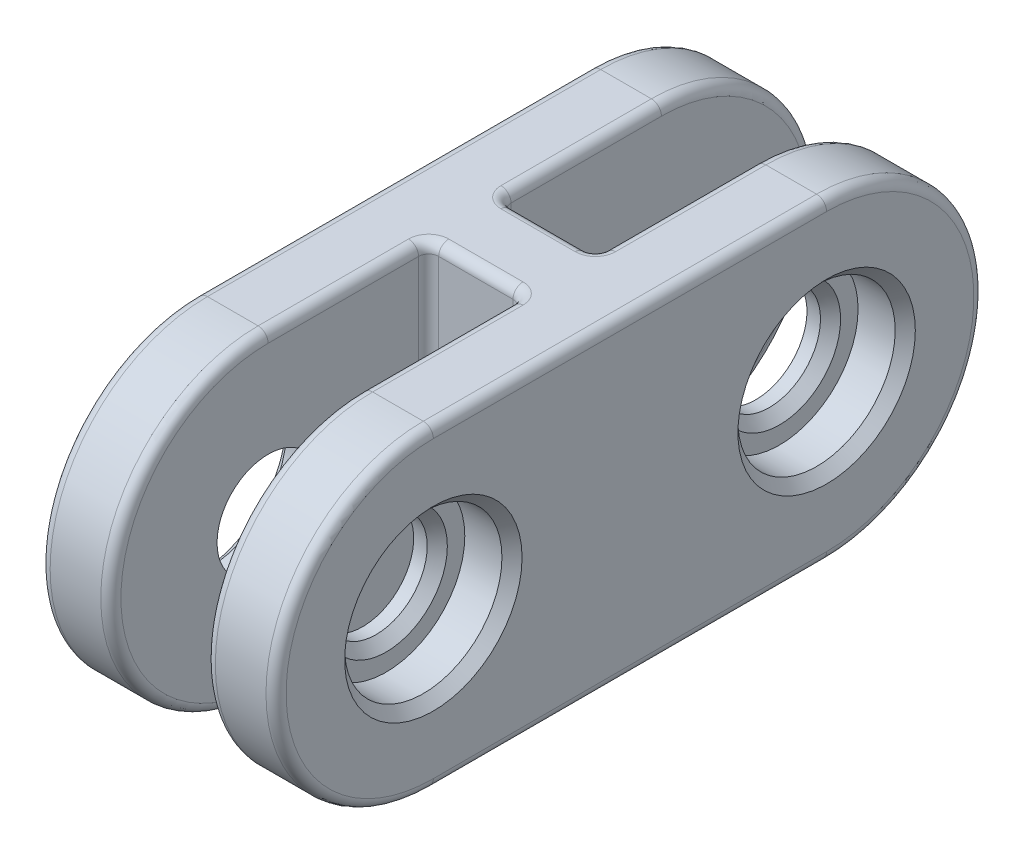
from build123d import *

# Parameters (mm, degrees)
SKETCH1_R          = 4.1275
EXTRUDE1_DEPTH     = 9.525
SKETCH2_R          = 6.35
CUT_EXTRUDE1_DEPTH = 3.81
SKETCH3_W          = 7.62
SKETCH3_H          = 25.654
CUT_EXTRUDE2_DEPTH = 53.073871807
FILLET1_R          = 0.8128
CHAMFER1_SIZE      = 0.8128


with BuildPart() as part:
    # Sketch1 → Extrude1 (new, symmetric)
    with BuildSketch(Plane(origin=(0, 0, 0), x_dir=(0, 0, -1), z_dir=(1, 0, 0))):
        with BuildLine():
            Line((0, 12.7), (31.75, 12.7))
            ThreePointArc((31.75, 12.7), (44.45, 0), (31.75, -12.7))
            Line((31.75, -12.7), (0, -12.7))
            ThreePointArc((0, -12.7), (-12.7, 0), (0, 12.7))
        make_face()
        with Locations(Location((0, 0, 0), (0, 0, 180))):
            Circle(SKETCH1_R, mode=Mode.SUBTRACT)
        with Locations(Location((31.75, 0, 0), (0, 0, 180))):
            Circle(SKETCH1_R, mode=Mode.SUBTRACT)
    extrude(amount=EXTRUDE1_DEPTH, both=True)

    # Sketch2 → Cut-Extrude1 (cut)
    with BuildSketch(Plane(origin=(9.525, 0, 0), x_dir=(0, 0, -1), z_dir=(1, 0, 0))):
        with Locations((31.75, 0)):
            Circle(SKETCH2_R)
        Circle(SKETCH2_R)
    cut_extrude1 = extrude(amount=-CUT_EXTRUDE1_DEPTH, mode=Mode.SUBTRACT)

    # Mirror1: Cut-Extrude1 across plane
    add(cut_extrude1.mirror(Plane(origin=(0, 0, 0), x_dir=(0, 0, 1), z_dir=(1, 0, 0))), mode=Mode.SUBTRACT)

    # Sketch3 → Cut-Extrude2 (cut, through all)
    with BuildSketch(Plane(origin=(0, 12.7, 0), x_dir=(-1, 0, 0), z_dir=(0, 1, 0))):
        with Locations((0, -31.623)):
            Rectangle(SKETCH3_W, SKETCH3_H)
        with Locations((0, -0.127)):
            Rectangle(SKETCH3_W, SKETCH3_H)
    extrude(amount=-CUT_EXTRUDE2_DEPTH, mode=Mode.SUBTRACT)

    # Fillet1
    fillet1_edges = [part.edges().sort_by_distance(p)[0] for p in [
        (9.525, 0, 12.7),
        (9.525, -12.7, -15.875),
        (9.525, 0, -44.45),
        (-9.525, -12.7, -15.875),
        (-9.525, 0, 12.7),
        (-3.81, -12.7, -25.273),
        (-9.525, 12.7, -15.875),
        (3.81, 12.7, -25.273),
        (-3.81, 12.7, -25.273),
        (0, 12.7, -18.796),
        (-9.525, 0, -44.45),
        (-3.81, 0, -44.45),
        (-3.81, 0, -18.796),
        (3.81, 0, -44.45),
        (3.81, -12.7, -25.273),
        (0, -12.7, -18.796),
        (3.81, 0, -18.796),
        (3.81, -12.7, -6.477),
        (9.525, 12.7, -15.875),
        (-3.81, 0, 12.7),
        (-3.81, -12.7, -6.477),
        (3.81, 0, 12.7),
        (3.81, 0, -12.954),
        (0, -12.7, -12.954),
        (-3.81, 0, -12.954),
        (3.81, 12.7, -6.477),
        (0, 12.7, -12.954),
        (-3.81, 12.7, -6.477),
    ]]
    fillet(fillet1_edges, radius=FILLET1_R)

    # Chamfer1
    chamfer1_edges = [part.edges().sort_by_distance(p)[0] for p in [
        (5.715, 0, -35.8775),
        (9.525, 0, -25.4),
        (5.715, 0, -4.1275),
        (9.525, 0, 6.35),
        (-9.525, 0, -25.4),
        (-5.715, 0, -35.8775),
        (-9.525, 0, 6.35),
        (-5.715, 0, -4.1275),
    ]]
    chamfer(chamfer1_edges, length=CHAMFER1_SIZE)


solid = part.part
